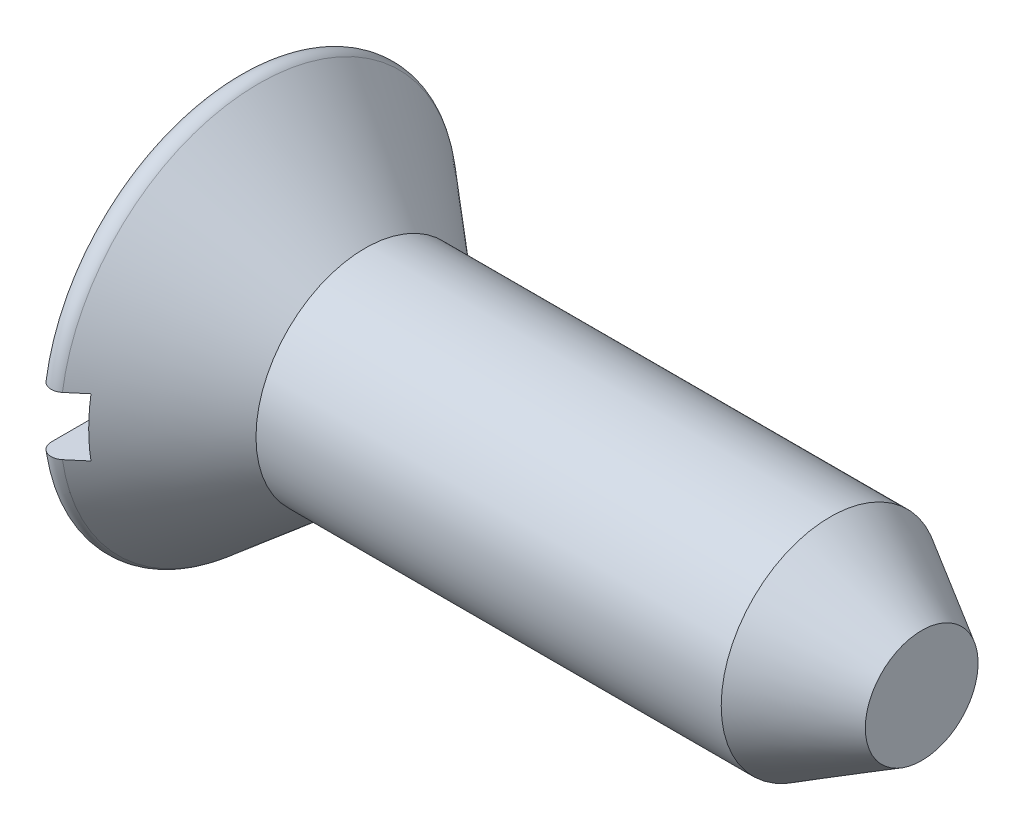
ISO-10303-21;
HEADER;
FILE_DESCRIPTION(('STEP AP214'),'2;1');
FILE_NAME('part.step','',(''),(''),'','','');
FILE_SCHEMA(('AUTOMOTIVE_DESIGN { 1 0 10303 214 1 1 1 1 }'));
ENDSEC;
DATA;
#1=APPLICATION_CONTEXT('core data for automotive mechanical design processes');
#2=APPLICATION_PROTOCOL_DEFINITION('international standard','automotive_design',2000,#1);
#3=PRODUCT_CONTEXT('',#1,'mechanical');
#4=PRODUCT('Part','Part','',(#3));
#5=PRODUCT_RELATED_PRODUCT_CATEGORY('part','',(#4));
#6=PRODUCT_DEFINITION_FORMATION('','',#4);
#7=PRODUCT_DEFINITION_CONTEXT('part definition',#1,'design');
#8=PRODUCT_DEFINITION('design','',#6,#7);
#9=PRODUCT_DEFINITION_SHAPE('','',#8);
#10=(LENGTH_UNIT() NAMED_UNIT(*) SI_UNIT(.MILLI.,.METRE.));
#11=(NAMED_UNIT(*) PLANE_ANGLE_UNIT() SI_UNIT($,.RADIAN.));
#12=(NAMED_UNIT(*) SI_UNIT($,.STERADIAN.) SOLID_ANGLE_UNIT());
#13=UNCERTAINTY_MEASURE_WITH_UNIT(LENGTH_MEASURE(1.E-05),#10,'distance_accuracy_value','');
#14=(GEOMETRIC_REPRESENTATION_CONTEXT(3) GLOBAL_UNCERTAINTY_ASSIGNED_CONTEXT((#13)) GLOBAL_UNIT_ASSIGNED_CONTEXT((#10,
#11,#12)) REPRESENTATION_CONTEXT('',''));
#15=CARTESIAN_POINT('',(0.,0.,0.));
#16=DIRECTION('',(0.,0.,1.));
#17=DIRECTION('',(1.,0.,0.));
#18=AXIS2_PLACEMENT_3D('',#15,#16,#17);
#19=CARTESIAN_POINT('',(0.,0.,0.));
#20=DIRECTION('',(-1.,0.,0.));
#21=DIRECTION('',(0.,0.,1.));
#22=AXIS2_PLACEMENT_3D('',#19,#20,#21);
#23=CYLINDRICAL_SURFACE('',#22,0.762);
#24=CARTESIAN_POINT('',(0.889,0.,0.));
#25=DIRECTION('',(-1.,0.,0.));
#26=DIRECTION('',(0.,0.,1.));
#27=AXIS2_PLACEMENT_3D('',#24,#25,#26);
#28=CIRCLE('',#27,0.762);
#29=CARTESIAN_POINT('',(0.889,0.,0.762));
#30=VERTEX_POINT('',#29);
#31=EDGE_CURVE('E166',#30,#30,#28,.T.);
#32=ORIENTED_EDGE('',*,*,#31,.F.);
#33=EDGE_LOOP('',(#32));
#34=FACE_BOUND('',#33,.T.);
#35=CARTESIAN_POINT('',(4.13728568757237,0.,0.));
#36=DIRECTION('',(-1.,0.,0.));
#37=DIRECTION('',(0.,0.,1.));
#38=AXIS2_PLACEMENT_3D('',#35,#36,#37);
#39=CIRCLE('',#38,0.762);
#40=CARTESIAN_POINT('',(4.13728568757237,0.,0.762));
#41=VERTEX_POINT('',#40);
#42=EDGE_CURVE('E215',#41,#41,#39,.T.);
#43=ORIENTED_EDGE('',*,*,#42,.T.);
#44=EDGE_LOOP('',(#43));
#45=FACE_BOUND('',#44,.T.);
#46=ADVANCED_FACE('F70',(#34,#45),#23,.T.);
#47=CARTESIAN_POINT('',(0.,0.,0.));
#48=DIRECTION('',(1.,0.,0.));
#49=DIRECTION('',(0.,0.,-1.));
#50=AXIS2_PLACEMENT_3D('',#47,#48,#49);
#51=PLANE('',#50);
#52=CARTESIAN_POINT('',(0.,0.,0.));
#53=DIRECTION('',(-1.,0.,0.));
#54=DIRECTION('',(0.,0.,1.));
#55=AXIS2_PLACEMENT_3D('',#52,#53,#54);
#56=CIRCLE('',#55,1.3173129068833);
#57=CARTESIAN_POINT('',(0.,0.2032,1.30154640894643));
#58=VERTEX_POINT('',#57);
#59=CARTESIAN_POINT('',(0.,0.2032,-1.30154640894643));
#60=VERTEX_POINT('',#59);
#61=EDGE_CURVE('E155',#58,#60,#56,.T.);
#62=ORIENTED_EDGE('',*,*,#61,.T.);
#63=DIRECTION('',(0.,0.,1.));
#64=VECTOR('',#63,1.);
#65=CARTESIAN_POINT('',(0.,0.2032,-1.4062129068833));
#66=LINE('',#65,#64);
#67=EDGE_CURVE('E200',#60,#58,#66,.T.);
#68=ORIENTED_EDGE('',*,*,#67,.T.);
#69=EDGE_LOOP('',(#62,#68));
#70=FACE_BOUND('',#69,.T.);
#71=ADVANCED_FACE('F227',(#70),#51,.F.);
#72=CARTESIAN_POINT('',(0.0889,0.,0.));
#73=DIRECTION('',(-1.,0.,0.));
#74=DIRECTION('',(0.,0.,1.));
#75=AXIS2_PLACEMENT_3D('',#72,#73,#74);
#76=TOROIDAL_SURFACE('',#75,1.3173129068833,0.0889000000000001);
#77=CARTESIAN_POINT('',(0.146043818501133,0.,0.));
#78=DIRECTION('',(-1.,0.,0.));
#79=DIRECTION('',(0.,0.,1.));
#80=AXIS2_PLACEMENT_3D('',#77,#78,#79);
#81=CIRCLE('',#80,1.38541425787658);
#82=CARTESIAN_POINT('',(0.146043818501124,0.2032,1.3704314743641));
#83=VERTEX_POINT('',#82);
#84=CARTESIAN_POINT('',(0.146043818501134,0.2032,-1.37043147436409));
#85=VERTEX_POINT('',#84);
#86=EDGE_CURVE('E162',#83,#85,#81,.T.);
#87=ORIENTED_EDGE('',*,*,#86,.T.);
#88=CARTESIAN_POINT('',(0.0303689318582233,0.2032,-1.36922992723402));
#89=CARTESIAN_POINT('',(0.0265865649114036,0.2032,-1.36588480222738));
#90=CARTESIAN_POINT('',(0.023086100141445,0.2032,-1.36221498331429));
#91=CARTESIAN_POINT('',(0.0167499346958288,0.2032,-1.35433519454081));
#92=CARTESIAN_POINT('',(0.0139151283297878,0.2032,-1.35012450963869));
#93=CARTESIAN_POINT('',(0.00899300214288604,0.2032,-1.34129166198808));
#94=CARTESIAN_POINT('',(0.00690499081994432,0.2032,-1.33666988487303));
#95=CARTESIAN_POINT('',(0.00352865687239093,0.2032,-1.32714461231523));
#96=CARTESIAN_POINT('',(0.00224013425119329,0.2032,-1.32224118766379));
#97=CARTESIAN_POINT('',(0.000488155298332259,0.2032,-1.31225105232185));
#98=CARTESIAN_POINT('',(3.09699241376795E-05,0.2032,-1.3071632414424));
#99=CARTESIAN_POINT('',(-2.79271646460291E-05,0.2032,-1.29698236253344));
#100=CARTESIAN_POINT('',(0.000370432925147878,0.2032,-1.29188929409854));
#101=CARTESIAN_POINT('',(0.00201624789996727,0.2032,-1.28181321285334));
#102=CARTESIAN_POINT('',(0.00326837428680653,0.2032,-1.27683096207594));
#103=CARTESIAN_POINT('',(0.00659289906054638,0.2032,-1.26714792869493));
#104=CARTESIAN_POINT('',(0.00866529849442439,0.2032,-1.2624471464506));
#105=CARTESIAN_POINT('',(0.0135694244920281,0.2032,-1.25347221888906));
#106=CARTESIAN_POINT('',(0.0163995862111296,0.2032,-1.24919721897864));
#107=CARTESIAN_POINT('',(0.0227439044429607,0.2032,-1.24118890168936));
#108=CARTESIAN_POINT('',(0.026258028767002,0.2032,-1.23745555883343));
#109=CARTESIAN_POINT('',(0.0338355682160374,0.2032,-1.2306760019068));
#110=CARTESIAN_POINT('',(0.0378934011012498,0.2032,-1.22762355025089));
#111=CARTESIAN_POINT('',(0.0464695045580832,0.2032,-1.22225388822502));
#112=CARTESIAN_POINT('',(0.0509877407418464,0.2032,-1.21993662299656));
#113=CARTESIAN_POINT('',(0.060292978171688,0.2032,-1.21613485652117));
#114=CARTESIAN_POINT('',(0.0650756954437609,0.2032,-1.21463986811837));
#115=CARTESIAN_POINT('',(0.0748254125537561,0.2032,-1.21248323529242));
#116=CARTESIAN_POINT('',(0.0797924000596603,0.2032,-1.21182153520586));
#117=CARTESIAN_POINT('',(0.0897162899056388,0.2032,-1.21135459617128));
#118=CARTESIAN_POINT('',(0.0946727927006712,0.2032,-1.21154082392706));
#119=CARTESIAN_POINT('',(0.104483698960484,0.2032,-1.21274443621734));
#120=CARTESIAN_POINT('',(0.109338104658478,0.2032,-1.21376180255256));
#121=CARTESIAN_POINT('',(0.11879915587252,0.2032,-1.21659385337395));
#122=CARTESIAN_POINT('',(0.123406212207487,0.2032,-1.21840716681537));
#123=CARTESIAN_POINT('',(0.132253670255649,0.2032,-1.22277598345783));
#124=CARTESIAN_POINT('',(0.136494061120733,0.2032,-1.22533150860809));
#125=CARTESIAN_POINT('',(0.144522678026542,0.2032,-1.23113086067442));
#126=CARTESIAN_POINT('',(0.148307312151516,0.2032,-1.23437965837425));
#127=CARTESIAN_POINT('',(0.155285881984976,0.2032,-1.24145937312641));
#128=CARTESIAN_POINT('',(0.158479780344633,0.2032,-1.24529032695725));
#129=CARTESIAN_POINT('',(0.16422909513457,0.2032,-1.25347716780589));
#130=CARTESIAN_POINT('',(0.166775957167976,0.2032,-1.25783906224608));
#131=CARTESIAN_POINT('',(0.171110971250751,0.2032,-1.26692483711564));
#132=CARTESIAN_POINT('',(0.172899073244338,0.2032,-1.27164874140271));
#133=CARTESIAN_POINT('',(0.175685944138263,0.2032,-1.28138319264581));
#134=CARTESIAN_POINT('',(0.176675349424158,0.2032,-1.28639642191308));
#135=CARTESIAN_POINT('',(0.177803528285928,0.2032,-1.29651778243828));
#136=CARTESIAN_POINT('',(0.177942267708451,0.2032,-1.30162591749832));
#137=CARTESIAN_POINT('',(0.17736314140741,0.2032,-1.31182120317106));
#138=CARTESIAN_POINT('',(0.17664065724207,0.2032,-1.31690809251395));
#139=CARTESIAN_POINT('',(0.174349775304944,0.2032,-1.32688782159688));
#140=CARTESIAN_POINT('',(0.17278138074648,0.2032,-1.33178066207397));
#141=CARTESIAN_POINT('',(0.168845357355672,0.2032,-1.34121887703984));
#142=CARTESIAN_POINT('',(0.166479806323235,0.2032,-1.34576511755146));
#143=CARTESIAN_POINT('',(0.161012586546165,0.2032,-1.35439120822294));
#144=CARTESIAN_POINT('',(0.15791094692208,0.2032,-1.35847107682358));
#145=CARTESIAN_POINT('',(0.151087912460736,0.2032,-1.36600970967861));
#146=CARTESIAN_POINT('',(0.147372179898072,0.2032,-1.36947359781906));
#147=CARTESIAN_POINT('',(0.139406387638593,0.2032,-1.37572010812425));
#148=CARTESIAN_POINT('',(0.135156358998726,0.2032,-1.37850276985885));
#149=CARTESIAN_POINT('',(0.126292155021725,0.2032,-1.38327612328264));
#150=CARTESIAN_POINT('',(0.121682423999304,0.2032,-1.38527506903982));
#151=CARTESIAN_POINT('',(0.112191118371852,0.2032,-1.38846296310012));
#152=CARTESIAN_POINT('',(0.107309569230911,0.2032,-1.38965198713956));
#153=CARTESIAN_POINT('',(0.0974585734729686,0.2032,-1.3911772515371));
#154=CARTESIAN_POINT('',(0.0924902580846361,0.2032,-1.39152080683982));
#155=CARTESIAN_POINT('',(0.0825654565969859,0.2032,-1.39136597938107));
#156=CARTESIAN_POINT('',(0.0776089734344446,0.2032,-1.39086740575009));
#157=CARTESIAN_POINT('',(0.0678643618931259,0.2032,-1.38904589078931));
#158=CARTESIAN_POINT('',(0.0630758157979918,0.2032,-1.38772517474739));
#159=CARTESIAN_POINT('',(0.0537917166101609,0.2032,-1.38430152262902));
#160=CARTESIAN_POINT('',(0.049295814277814,0.2032,-1.38219953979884));
#161=CARTESIAN_POINT('',(0.0423987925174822,0.2032,-1.37824212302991));
#162=CARTESIAN_POINT('',(0.0398658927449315,0.2032,-1.37661158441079));
#163=CARTESIAN_POINT('',(0.0349782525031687,0.2032,-1.37310246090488));
#164=CARTESIAN_POINT('',(0.0326235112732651,0.2032,-1.37122387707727));
#165=CARTESIAN_POINT('',(0.0303689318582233,0.2032,-1.36922992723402));
#166=B_SPLINE_CURVE_WITH_KNOTS('',3,(#88,#89,#90,#91,#92,#93,#94,#95,#96,#97,#98,#99,#100,#101,
#102,#103,#104,#105,#106,#107,#108,#109,#110,#111,#112,#113,#114,#115,#116,#117,#118,#119,#120,
#121,#122,#123,#124,#125,#126,#127,#128,#129,#130,#131,#132,#133,#134,#135,#136,#137,#138,#139,
#140,#141,#142,#143,#144,#145,#146,#147,#148,#149,#150,#151,#152,#153,#154,#155,#156,#157,#158,
#159,#160,#161,#162,#163,#164,#165),.UNSPECIFIED.,.T.,.F.,(4,2,2,2,2,2,2,2,2,2,2,2,2,2,2,2,2,2,
2,2,2,2,2,2,2,2,2,2,2,2,2,2,2,2,2,2,2,2,4),(0.,0.0151369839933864,0.0302941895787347,
0.0454373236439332,0.0605766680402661,0.0758297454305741,0.0910841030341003,0.106422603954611,
0.12176112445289,0.137068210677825,0.15237457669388,0.167534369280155,0.18269303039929,
0.197653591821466,0.212613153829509,0.227422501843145,0.242231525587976,0.257015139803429,
0.271799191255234,0.28669303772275,0.301587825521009,0.316670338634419,0.331753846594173,
0.347011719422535,0.36227020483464,0.377610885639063,0.392951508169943,0.408252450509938,
0.423552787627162,0.438719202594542,0.453884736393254,0.468885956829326,0.483885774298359,
0.498755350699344,0.513628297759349,0.528461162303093,0.543275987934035,0.552298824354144,
0.561321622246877),.UNSPECIFIED.);
#167=EDGE_CURVE('E173',#85,#60,#166,.T.);
#168=ORIENTED_EDGE('',*,*,#167,.T.);
#169=ORIENTED_EDGE('',*,*,#61,.F.);
#170=CARTESIAN_POINT('',(0.0519994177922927,0.2032,1.21962139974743));
#171=CARTESIAN_POINT('',(0.0474515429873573,0.2032,1.22172518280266));
#172=CARTESIAN_POINT('',(0.0430795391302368,0.2032,1.22421847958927));
#173=CARTESIAN_POINT('',(0.0348144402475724,0.2032,1.22990833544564));
#174=CARTESIAN_POINT('',(0.0309219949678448,0.2032,1.23310583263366));
#175=CARTESIAN_POINT('',(0.0237310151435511,0.2032,1.24010395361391));
#176=CARTESIAN_POINT('',(0.0204318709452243,0.2032,1.24390395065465));
#177=CARTESIAN_POINT('',(0.0145121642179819,0.2032,1.25199814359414));
#178=CARTESIAN_POINT('',(0.0118914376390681,0.2032,1.25629221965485));
#179=CARTESIAN_POINT('',(0.0073742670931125,0.2032,1.26529746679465));
#180=CARTESIAN_POINT('',(0.00548500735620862,0.2032,1.27001224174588));
#181=CARTESIAN_POINT('',(0.00251643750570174,0.2032,1.27969048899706));
#182=CARTESIAN_POINT('',(0.00143720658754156,0.2032,1.2846539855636));
#183=CARTESIAN_POINT('',(0.000111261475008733,0.2032,1.29473808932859));
#184=CARTESIAN_POINT('',(-0.000127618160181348,0.2032,1.29985972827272));
#185=CARTESIAN_POINT('',(0.000256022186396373,0.2032,1.31007074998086));
#186=CARTESIAN_POINT('',(0.000878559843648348,0.2032,1.31516013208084));
#187=CARTESIAN_POINT('',(0.00297131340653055,0.2032,1.32517157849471));
#188=CARTESIAN_POINT('',(0.00444309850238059,0.2032,1.33009331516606));
#189=CARTESIAN_POINT('',(0.00819672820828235,0.2032,1.33961767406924));
#190=CARTESIAN_POINT('',(0.0104785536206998,0.2032,1.34422030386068));
#191=CARTESIAN_POINT('',(0.0157751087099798,0.2032,1.35294667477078));
#192=CARTESIAN_POINT('',(0.0187855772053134,0.2032,1.35707300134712));
#193=CARTESIAN_POINT('',(0.0254631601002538,0.2032,1.36475501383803));
#194=CARTESIAN_POINT('',(0.029130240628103,0.2032,1.36831072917));
#195=CARTESIAN_POINT('',(0.0369769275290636,0.2032,1.37471139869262));
#196=CARTESIAN_POINT('',(0.0411508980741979,0.2032,1.3775632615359));
#197=CARTESIAN_POINT('',(0.0499223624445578,0.2032,1.3825171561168));
#198=CARTESIAN_POINT('',(0.0545198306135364,0.2032,1.38461923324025));
#199=CARTESIAN_POINT('',(0.0639565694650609,0.2032,1.38799180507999));
#200=CARTESIAN_POINT('',(0.0687928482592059,0.2032,1.38927067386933));
#201=CARTESIAN_POINT('',(0.0786119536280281,0.2032,1.39099241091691));
#202=CARTESIAN_POINT('',(0.0835947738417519,0.2032,1.39143531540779));
#203=CARTESIAN_POINT('',(0.0935311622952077,0.2032,1.39147158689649));
#204=CARTESIAN_POINT('',(0.0984847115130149,0.2032,1.39107042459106));
#205=CARTESIAN_POINT('',(0.108253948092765,0.2032,1.38944176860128));
#206=CARTESIAN_POINT('',(0.113069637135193,0.2032,1.38821428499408));
#207=CARTESIAN_POINT('',(0.122425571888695,0.2032,1.38497028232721));
#208=CARTESIAN_POINT('',(0.126965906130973,0.2032,1.38295401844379));
#209=CARTESIAN_POINT('',(0.135646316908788,0.2032,1.37819212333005));
#210=CARTESIAN_POINT('',(0.139786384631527,0.2032,1.37544647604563));
#211=CARTESIAN_POINT('',(0.147575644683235,0.2032,1.36928772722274));
#212=CARTESIAN_POINT('',(0.151221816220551,0.2032,1.36587080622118));
#213=CARTESIAN_POINT('',(0.157895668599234,0.2032,1.35847870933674));
#214=CARTESIAN_POINT('',(0.160923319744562,0.2032,1.35450350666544));
#215=CARTESIAN_POINT('',(0.166306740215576,0.2032,1.34606549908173));
#216=CARTESIAN_POINT('',(0.16865549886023,0.2032,1.34159822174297));
#217=CARTESIAN_POINT('',(0.172578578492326,0.2032,1.33233569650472));
#218=CARTESIAN_POINT('',(0.174152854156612,0.2032,1.32754042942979));
#219=CARTESIAN_POINT('',(0.176498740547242,0.2032,1.31770435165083));
#220=CARTESIAN_POINT('',(0.177261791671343,0.2032,1.31266149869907));
#221=CARTESIAN_POINT('',(0.177936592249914,0.2032,1.30251909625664));
#222=CARTESIAN_POINT('',(0.177848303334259,0.2032,1.29741954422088));
#223=CARTESIAN_POINT('',(0.176819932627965,0.2032,1.2872727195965));
#224=CARTESIAN_POINT('',(0.175874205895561,0.2032,1.28222601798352));
#225=CARTESIAN_POINT('',(0.17314855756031,0.2032,1.27236297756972));
#226=CARTESIAN_POINT('',(0.171368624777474,0.2032,1.26754664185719));
#227=CARTESIAN_POINT('',(0.167023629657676,0.2032,1.25828533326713));
#228=CARTESIAN_POINT('',(0.164459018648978,0.2032,1.2538401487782));
#229=CARTESIAN_POINT('',(0.158613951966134,0.2032,1.24544815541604));
#230=CARTESIAN_POINT('',(0.155333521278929,0.2032,1.24150132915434));
#231=CARTESIAN_POINT('',(0.148178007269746,0.2032,1.23425489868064));
#232=CARTESIAN_POINT('',(0.144308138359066,0.2032,1.23095014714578));
#233=CARTESIAN_POINT('',(0.136062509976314,0.2032,1.22504752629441));
#234=CARTESIAN_POINT('',(0.131686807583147,0.2032,1.22244957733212));
#235=CARTESIAN_POINT('',(0.122614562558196,0.2032,1.21806993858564));
#236=CARTESIAN_POINT('',(0.117922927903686,0.2032,1.21627808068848));
#237=CARTESIAN_POINT('',(0.108302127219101,0.2032,1.21351705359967));
#238=CARTESIAN_POINT('',(0.103372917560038,0.2032,1.21254803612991));
#239=CARTESIAN_POINT('',(0.093474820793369,0.2032,1.21146948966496));
#240=CARTESIAN_POINT('',(0.0885069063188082,0.2032,1.21135096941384));
#241=CARTESIAN_POINT('',(0.0786266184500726,0.2032,1.21195374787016));
#242=CARTESIAN_POINT('',(0.0737141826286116,0.2032,1.21267398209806));
#243=CARTESIAN_POINT('',(0.0659940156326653,0.2032,1.21448083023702));
#244=CARTESIAN_POINT('',(0.0631233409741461,0.2032,1.21530932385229));
#245=CARTESIAN_POINT('',(0.0574807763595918,0.2032,1.21725292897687));
#246=CARTESIAN_POINT('',(0.0547088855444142,0.2032,1.21836803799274));
#247=CARTESIAN_POINT('',(0.0519994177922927,0.2032,1.21962139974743));
#248=B_SPLINE_CURVE_WITH_KNOTS('',3,(#170,#171,#172,#173,#174,#175,#176,#177,#178,#179,#180,
#181,#182,#183,#184,#185,#186,#187,#188,#189,#190,#191,#192,#193,#194,#195,#196,#197,#198,#199,
#200,#201,#202,#203,#204,#205,#206,#207,#208,#209,#210,#211,#212,#213,#214,#215,#216,#217,#218,
#219,#220,#221,#222,#223,#224,#225,#226,#227,#228,#229,#230,#231,#232,#233,#234,#235,#236,#237,
#238,#239,#240,#241,#242,#243,#244,#245,#246,#247),.UNSPECIFIED.,.T.,.F.,(4,2,2,2,2,2,2,2,2,2,2,
2,2,2,2,2,2,2,2,2,2,2,2,2,2,2,2,2,2,2,2,2,2,2,2,2,2,2,4),(0.,0.0150216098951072,
0.0300633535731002,0.0450895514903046,0.0601121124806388,0.0752786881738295,0.0904467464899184,
0.10575584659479,0.121065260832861,0.136403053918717,0.151740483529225,0.166990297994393,
0.182239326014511,0.197332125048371,0.21242401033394,0.227359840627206,0.242295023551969,
0.257133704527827,0.271972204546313,0.286805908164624,0.30163993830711,0.316560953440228,
0.331482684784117,0.346553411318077,0.361625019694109,0.376854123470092,0.392083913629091,
0.40741470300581,0.422745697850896,0.438067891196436,0.453389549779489,0.468582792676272,
0.483774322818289,0.498768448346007,0.513765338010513,0.528603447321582,0.543422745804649,
0.552372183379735,0.561321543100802),.UNSPECIFIED.);
#249=EDGE_CURVE('E169',#58,#83,#248,.T.);
#250=ORIENTED_EDGE('',*,*,#249,.T.);
#251=EDGE_LOOP('',(#87,#168,#169,#250));
#252=FACE_BOUND('',#251,.T.);
#253=ADVANCED_FACE('F207',(#252),#76,.T.);
#254=CARTESIAN_POINT('',(0.,-0.2032,-1.30154640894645));
#255=VERTEX_POINT('',#254);
#256=CARTESIAN_POINT('',(0.,-0.2032,1.30154640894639));
#257=VERTEX_POINT('',#256);
#258=EDGE_CURVE('E157',#255,#257,#56,.T.);
#259=ORIENTED_EDGE('',*,*,#258,.T.);
#260=DIRECTION('',(0.,0.,1.));
#261=VECTOR('',#260,1.);
#262=CARTESIAN_POINT('',(0.,-0.2032,-1.4062129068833));
#263=LINE('',#262,#261);
#264=EDGE_CURVE('E142',#255,#257,#263,.T.);
#265=ORIENTED_EDGE('',*,*,#264,.F.);
#266=EDGE_LOOP('',(#259,#265));
#267=FACE_BOUND('',#266,.T.);
#268=ADVANCED_FACE('F72',(#267),#51,.F.);
#269=ORIENTED_EDGE('',*,*,#258,.F.);
#270=CARTESIAN_POINT('',(0.0303689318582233,-0.2032,-1.36922992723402));
#271=CARTESIAN_POINT('',(0.0340946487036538,-0.2032,-1.37252435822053));
#272=CARTESIAN_POINT('',(0.0380991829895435,-0.2032,-1.37550858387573));
#273=CARTESIAN_POINT('',(0.0465549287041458,-0.2032,-1.38076603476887));
#274=CARTESIAN_POINT('',(0.051006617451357,-0.2032,-1.38303848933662));
#275=CARTESIAN_POINT('',(0.0602289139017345,-0.2032,-1.38680158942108));
#276=CARTESIAN_POINT('',(0.0649994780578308,-0.2032,-1.38829234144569));
#277=CARTESIAN_POINT('',(0.0747226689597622,-0.2032,-1.39044677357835));
#278=CARTESIAN_POINT('',(0.079675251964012,-0.2032,-1.39111065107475));
#279=CARTESIAN_POINT('',(0.0895971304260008,-0.2032,-1.39159075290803));
#280=CARTESIAN_POINT('',(0.094566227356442,-0.2032,-1.39141108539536));
#281=CARTESIAN_POINT('',(0.104403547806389,-0.2032,-1.39021889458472));
#282=CARTESIAN_POINT('',(0.109271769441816,-0.2032,-1.38920635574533));
#283=CARTESIAN_POINT('',(0.118763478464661,-0.2032,-1.38638053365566));
#284=CARTESIAN_POINT('',(0.123387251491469,-0.2032,-1.38456820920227));
#285=CARTESIAN_POINT('',(0.132267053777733,-0.2032,-1.38019684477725));
#286=CARTESIAN_POINT('',(0.136523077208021,-0.2032,-1.37763779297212));
#287=CARTESIAN_POINT('',(0.144570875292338,-0.2032,-1.37183291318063));
#288=CARTESIAN_POINT('',(0.148360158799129,-0.2032,-1.3685836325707));
#289=CARTESIAN_POINT('',(0.155345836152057,-0.2032,-1.36150050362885));
#290=CARTESIAN_POINT('',(0.158542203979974,-0.2032,-1.35766662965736));
#291=CARTESIAN_POINT('',(0.164284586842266,-0.2032,-1.34948404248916));
#292=CARTESIAN_POINT('',(0.166824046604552,-0.2032,-1.34513072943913));
#293=CARTESIAN_POINT('',(0.171144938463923,-0.2032,-1.33606294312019));
#294=CARTESIAN_POINT('',(0.172926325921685,-0.2032,-1.33134844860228));
#295=CARTESIAN_POINT('',(0.175699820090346,-0.2032,-1.32163841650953));
#296=CARTESIAN_POINT('',(0.17668333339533,-0.2032,-1.31664042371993));
#297=CARTESIAN_POINT('',(0.177804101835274,-0.2032,-1.3065503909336));
#298=CARTESIAN_POINT('',(0.177941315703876,-0.2032,-1.30145834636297));
#299=CARTESIAN_POINT('',(0.17736442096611,-0.2032,-1.29128491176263));
#300=CARTESIAN_POINT('',(0.1766440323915,-0.2032,-1.28620387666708));
#301=CARTESIAN_POINT('',(0.174361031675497,-0.2032,-1.27623453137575));
#302=CARTESIAN_POINT('',(0.172798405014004,-0.2032,-1.27134622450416));
#303=CARTESIAN_POINT('',(0.168871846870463,-0.2032,-1.26189973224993));
#304=CARTESIAN_POINT('',(0.166507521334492,-0.2032,-1.25734171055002));
#305=CARTESIAN_POINT('',(0.16104173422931,-0.2032,-1.24869122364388));
#306=CARTESIAN_POINT('',(0.157940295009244,-0.2032,-1.24459874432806));
#307=CARTESIAN_POINT('',(0.151111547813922,-0.2032,-1.23702970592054));
#308=CARTESIAN_POINT('',(0.147389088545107,-0.2032,-1.23354877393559));
#309=CARTESIAN_POINT('',(0.139406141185,-0.2032,-1.2272708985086));
#310=CARTESIAN_POINT('',(0.135145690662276,-0.2032,-1.22447390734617));
#311=CARTESIAN_POINT('',(0.126265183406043,-0.2032,-1.21968113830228));
#312=CARTESIAN_POINT('',(0.121650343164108,-0.2032,-1.21767569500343));
#313=CARTESIAN_POINT('',(0.112146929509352,-0.2032,-1.21447850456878));
#314=CARTESIAN_POINT('',(0.107258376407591,-0.2032,-1.21328669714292));
#315=CARTESIAN_POINT('',(0.0974077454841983,-0.2032,-1.21176329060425));
#316=CARTESIAN_POINT('',(0.0924471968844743,-0.2032,-1.21142179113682));
#317=CARTESIAN_POINT('',(0.0825397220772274,-0.2032,-1.21158078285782));
#318=CARTESIAN_POINT('',(0.0775927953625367,-0.2032,-1.21208124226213));
#319=CARTESIAN_POINT('',(0.0678769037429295,-0.2032,-1.21390421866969));
#320=CARTESIAN_POINT('',(0.0631072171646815,-0.2032,-1.21522289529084));
#321=CARTESIAN_POINT('',(0.0538553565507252,-0.2032,-1.21863856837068));
#322=CARTESIAN_POINT('',(0.0493731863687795,-0.2032,-1.22073557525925));
#323=CARTESIAN_POINT('',(0.0407992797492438,-0.2032,-1.22565694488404));
#324=CARTESIAN_POINT('',(0.0367095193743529,-0.2032,-1.22848474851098));
#325=CARTESIAN_POINT('',(0.0290558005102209,-0.2032,-1.23477949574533));
#326=CARTESIAN_POINT('',(0.0254918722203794,-0.2032,-1.23824647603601));
#327=CARTESIAN_POINT('',(0.0189463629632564,-0.2032,-1.24576373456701));
#328=CARTESIAN_POINT('',(0.015972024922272,-0.2032,-1.24982031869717));
#329=CARTESIAN_POINT('',(0.0107366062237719,-0.2032,-1.25837020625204));
#330=CARTESIAN_POINT('',(0.00847557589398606,-0.2032,-1.2628635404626));
#331=CARTESIAN_POINT('',(0.00470202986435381,-0.2032,-1.27222012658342));
#332=CARTESIAN_POINT('',(0.00319927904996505,-0.2032,-1.27708731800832));
#333=CARTESIAN_POINT('',(0.00102525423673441,-0.2032,-1.28700385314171));
#334=CARTESIAN_POINT('',(0.000353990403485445,-0.2032,-1.29205319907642));
#335=CARTESIAN_POINT('',(-0.000140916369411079,-0.2032,-1.30223182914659));
#336=CARTESIAN_POINT('',(4.19118878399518E-05,-0.2032,-1.30736142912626));
#337=CARTESIAN_POINT('',(0.00126627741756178,-0.2032,-1.31751863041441));
#338=CARTESIAN_POINT('',(0.00230803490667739,-0.2032,-1.32254620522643));
#339=CARTESIAN_POINT('',(0.00522359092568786,-0.2032,-1.33235559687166));
#340=CARTESIAN_POINT('',(0.00709767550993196,-0.2032,-1.33713732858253));
#341=CARTESIAN_POINT('',(0.0116267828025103,-0.2032,-1.34631066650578));
#342=CARTESIAN_POINT('',(0.0142808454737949,-0.2032,-1.35070274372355));
#343=CARTESIAN_POINT('',(0.019197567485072,-0.2032,-1.35746258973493));
#344=CARTESIAN_POINT('',(0.0212509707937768,-0.2032,-1.35998521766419));
#345=CARTESIAN_POINT('',(0.0256195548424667,-0.2032,-1.36479267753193));
#346=CARTESIAN_POINT('',(0.0279347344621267,-0.2032,-1.36707751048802));
#347=CARTESIAN_POINT('',(0.0303689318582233,-0.2032,-1.36922992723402));
#348=B_SPLINE_CURVE_WITH_KNOTS('',3,(#270,#271,#272,#273,#274,#275,#276,#277,#278,#279,#280,
#281,#282,#283,#284,#285,#286,#287,#288,#289,#290,#291,#292,#293,#294,#295,#296,#297,#298,#299,
#300,#301,#302,#303,#304,#305,#306,#307,#308,#309,#310,#311,#312,#313,#314,#315,#316,#317,#318,
#319,#320,#321,#322,#323,#324,#325,#326,#327,#328,#329,#330,#331,#332,#333,#334,#335,#336,#337,
#338,#339,#340,#341,#342,#343,#344,#345,#346,#347),.UNSPECIFIED.,.T.,.F.,(4,2,2,2,2,2,2,2,2,2,2,
2,2,2,2,2,2,2,2,2,2,2,2,2,2,2,2,2,2,2,2,2,2,2,2,2,2,2,4),(0.,0.0149083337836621,
0.0298327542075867,0.0447551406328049,0.059673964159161,0.0745202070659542,0.0893667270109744,
0.104195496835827,0.119024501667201,0.133929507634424,0.148835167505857,0.163884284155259,
0.178934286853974,0.194144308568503,0.209355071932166,0.224677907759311,0.240001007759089,
0.25533165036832,0.270661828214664,0.28587748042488,0.30109207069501,0.316114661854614,
0.331136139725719,0.345981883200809,0.360827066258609,0.375603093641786,0.390379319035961,
0.405226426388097,0.420074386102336,0.435094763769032,0.450116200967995,0.465326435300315,
0.480536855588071,0.49586270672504,0.511192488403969,0.526527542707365,0.541843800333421,
0.551584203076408,0.561324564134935),.UNSPECIFIED.);
#349=CARTESIAN_POINT('',(0.146043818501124,-0.2032,-1.3704314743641));
#350=VERTEX_POINT('',#349);
#351=EDGE_CURVE('E199',#255,#350,#348,.T.);
#352=ORIENTED_EDGE('',*,*,#351,.T.);
#353=CARTESIAN_POINT('',(0.146043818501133,-0.2032,1.37043147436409));
#354=VERTEX_POINT('',#353);
#355=EDGE_CURVE('E148',#350,#354,#81,.T.);
#356=ORIENTED_EDGE('',*,*,#355,.T.);
#357=CARTESIAN_POINT('',(0.0519994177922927,-0.2032,1.21962139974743));
#358=CARTESIAN_POINT('',(0.0564794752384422,-0.2032,1.21754948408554));
#359=CARTESIAN_POINT('',(0.0611366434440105,-0.2032,1.21585248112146));
#360=CARTESIAN_POINT('',(0.0706733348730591,-0.2032,1.21326272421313));
#361=CARTESIAN_POINT('',(0.0755530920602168,-0.2032,1.2123708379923));
#362=CARTESIAN_POINT('',(0.0853922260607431,-0.2032,1.21142102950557));
#363=CARTESIAN_POINT('',(0.0903515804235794,-0.2032,1.21136287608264));
#364=CARTESIAN_POINT('',(0.100208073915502,-0.2032,1.2120819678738));
#365=CARTESIAN_POINT('',(0.10510522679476,-0.2032,1.21285902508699));
#366=CARTESIAN_POINT('',(0.114690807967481,-0.2032,1.21522197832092));
#367=CARTESIAN_POINT('',(0.119379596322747,-0.2032,1.21680641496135));
#368=CARTESIAN_POINT('',(0.128427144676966,-0.2032,1.22073528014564));
#369=CARTESIAN_POINT('',(0.132785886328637,-0.2032,1.22307975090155));
#370=CARTESIAN_POINT('',(0.14107975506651,-0.2032,1.22847581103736));
#371=CARTESIAN_POINT('',(0.145012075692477,-0.2032,1.23153171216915));
#372=CARTESIAN_POINT('',(0.152315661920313,-0.2032,1.23825300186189));
#373=CARTESIAN_POINT('',(0.155686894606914,-0.2032,1.24191842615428));
#374=CARTESIAN_POINT('',(0.161816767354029,-0.2032,1.24980237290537));
#375=CARTESIAN_POINT('',(0.164567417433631,-0.2032,1.25402710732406));
#376=CARTESIAN_POINT('',(0.169330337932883,-0.2032,1.26287406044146));
#377=CARTESIAN_POINT('',(0.171342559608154,-0.2032,1.26749630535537));
#378=CARTESIAN_POINT('',(0.174595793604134,-0.2032,1.27706722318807));
#379=CARTESIAN_POINT('',(0.175827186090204,-0.2032,1.28201916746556));
#380=CARTESIAN_POINT('',(0.17744716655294,-0.2032,1.29205912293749));
#381=CARTESIAN_POINT('',(0.177835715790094,-0.2032,1.29714714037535));
#382=CARTESIAN_POINT('',(0.177758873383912,-0.2032,1.30734995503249));
#383=CARTESIAN_POINT('',(0.177287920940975,-0.2032,1.31246471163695));
#384=CARTESIAN_POINT('',(0.175492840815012,-0.2032,1.32254238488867));
#385=CARTESIAN_POINT('',(0.174168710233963,-0.2032,1.32750530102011));
#386=CARTESIAN_POINT('',(0.170704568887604,-0.2032,1.33712973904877));
#387=CARTESIAN_POINT('',(0.168565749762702,-0.2032,1.34179168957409));
#388=CARTESIAN_POINT('',(0.163529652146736,-0.2032,1.35068630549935));
#389=CARTESIAN_POINT('',(0.160632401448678,-0.2032,1.35491898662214));
#390=CARTESIAN_POINT('',(0.154185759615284,-0.2032,1.36279755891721));
#391=CARTESIAN_POINT('',(0.150641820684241,-0.2032,1.36644791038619));
#392=CARTESIAN_POINT('',(0.142985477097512,-0.2032,1.37309384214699));
#393=CARTESIAN_POINT('',(0.138873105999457,-0.2032,1.37608946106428));
#394=CARTESIAN_POINT('',(0.130244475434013,-0.2032,1.3813065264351));
#395=CARTESIAN_POINT('',(0.125733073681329,-0.2032,1.38353600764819));
#396=CARTESIAN_POINT('',(0.116397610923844,-0.2032,1.38719789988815));
#397=CARTESIAN_POINT('',(0.111573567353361,-0.2032,1.38863035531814));
#398=CARTESIAN_POINT('',(0.101797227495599,-0.2032,1.39064517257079));
#399=CARTESIAN_POINT('',(0.096846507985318,-0.2032,1.39123519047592));
#400=CARTESIAN_POINT('',(0.0869165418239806,-0.2032,1.39157191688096));
#401=CARTESIAN_POINT('',(0.0819372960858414,-0.2032,1.39131865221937));
#402=CARTESIAN_POINT('',(0.0721129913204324,-0.2032,1.3899793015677));
#403=CARTESIAN_POINT('',(0.0672674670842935,-0.2032,1.38889662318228));
#404=CARTESIAN_POINT('',(0.0578263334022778,-0.2032,1.38593496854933));
#405=CARTESIAN_POINT('',(0.0532307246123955,-0.2032,1.38405599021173));
#406=CARTESIAN_POINT('',(0.0444074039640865,-0.2032,1.37955210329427));
#407=CARTESIAN_POINT('',(0.0401805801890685,-0.2032,1.37692545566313));
#408=CARTESIAN_POINT('',(0.0322234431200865,-0.2032,1.37100505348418));
#409=CARTESIAN_POINT('',(0.0284931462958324,-0.2032,1.36771127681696));
#410=CARTESIAN_POINT('',(0.0216026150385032,-0.2032,1.36052300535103));
#411=CARTESIAN_POINT('',(0.0184471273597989,-0.2032,1.35662396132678));
#412=CARTESIAN_POINT('',(0.0128273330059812,-0.2032,1.34835615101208));
#413=CARTESIAN_POINT('',(0.0103630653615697,-0.2032,1.34398735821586));
#414=CARTESIAN_POINT('',(0.00616781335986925,-0.2032,1.33485418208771));
#415=CARTESIAN_POINT('',(0.00444494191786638,-0.2032,1.33008607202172));
#416=CARTESIAN_POINT('',(0.00181577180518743,-0.2032,1.32032978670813));
#417=CARTESIAN_POINT('',(0.000909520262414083,-0.2032,1.31534159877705));
#418=CARTESIAN_POINT('',(-6.80779717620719E-05,-0.2032,1.30523659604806));
#419=CARTESIAN_POINT('',(-0.000131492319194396,-0.2032,1.30011901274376));
#420=CARTESIAN_POINT('',(0.000598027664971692,-0.2032,1.28994533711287));
#421=CARTESIAN_POINT('',(0.00139095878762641,-0.2032,1.28488924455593));
#422=CARTESIAN_POINT('',(0.00381642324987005,-0.2032,1.27496177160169));
#423=CARTESIAN_POINT('',(0.00545218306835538,-0.2032,1.27009117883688));
#424=CARTESIAN_POINT('',(0.00952181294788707,-0.2032,1.26069393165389));
#425=CARTESIAN_POINT('',(0.0119558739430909,-0.2032,1.25616735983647));
#426=CARTESIAN_POINT('',(0.0175456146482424,-0.2032,1.24760688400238));
#427=CARTESIAN_POINT('',(0.020698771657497,-0.2032,1.24357133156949));
#428=CARTESIAN_POINT('',(0.0276425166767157,-0.2032,1.23609810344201));
#429=CARTESIAN_POINT('',(0.0314322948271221,-0.2032,1.23265967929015));
#430=CARTESIAN_POINT('',(0.0380466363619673,-0.2032,1.22762005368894));
#431=CARTESIAN_POINT('',(0.040713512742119,-0.2032,1.2258082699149));
#432=CARTESIAN_POINT('',(0.0462282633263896,-0.2032,1.22248491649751));
#433=CARTESIAN_POINT('',(0.049076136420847,-0.2032,1.22097334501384));
#434=CARTESIAN_POINT('',(0.0519994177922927,-0.2032,1.21962139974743));
#435=B_SPLINE_CURVE_WITH_KNOTS('',3,(#357,#358,#359,#360,#361,#362,#363,#364,#365,#366,#367,
#368,#369,#370,#371,#372,#373,#374,#375,#376,#377,#378,#379,#380,#381,#382,#383,#384,#385,#386,
#387,#388,#389,#390,#391,#392,#393,#394,#395,#396,#397,#398,#399,#400,#401,#402,#403,#404,#405,
#406,#407,#408,#409,#410,#411,#412,#413,#414,#415,#416,#417,#418,#419,#420,#421,#422,#423,#424,
#425,#426,#427,#428,#429,#430,#431,#432,#433,#434),.UNSPECIFIED.,.T.,.F.,(4,2,2,2,2,2,2,2,2,2,2,
2,2,2,2,2,2,2,2,2,2,2,2,2,2,2,2,2,2,2,2,2,2,2,2,2,2,2,4),(0.,0.0147962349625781,
0.0296083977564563,0.0444164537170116,0.0592211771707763,0.0739992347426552,0.0887781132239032,
0.103649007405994,0.118520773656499,0.133574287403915,0.148628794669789,0.163865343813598,
0.179102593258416,0.194438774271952,0.209775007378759,0.225088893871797,0.240402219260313,
0.25559194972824,0.270780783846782,0.285805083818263,0.30082854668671,0.315714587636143,
0.330600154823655,0.345424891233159,0.360249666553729,0.375109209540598,0.389969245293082,
0.404946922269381,0.419925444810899,0.435063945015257,0.450203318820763,0.465485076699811,
0.480766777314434,0.496107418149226,0.511451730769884,0.526743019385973,0.542015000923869,
0.551669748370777,0.561324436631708),.UNSPECIFIED.);
#436=EDGE_CURVE('E91',#354,#257,#435,.T.);
#437=ORIENTED_EDGE('',*,*,#436,.T.);
#438=EDGE_LOOP('',(#269,#352,#356,#437));
#439=FACE_BOUND('',#438,.T.);
#440=ADVANCED_FACE('F177',(#439),#76,.T.);
#441=CARTESIAN_POINT('',(0.889,0.,0.));
#442=DIRECTION('',(-1.,0.,0.));
#443=DIRECTION('',(0.,0.,1.));
#444=AXIS2_PLACEMENT_3D('',#441,#442,#443);
#445=CONICAL_SURFACE('',#444,0.762,0.698131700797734);
#446=CARTESIAN_POINT('',(0.254,0.,0.));
#447=DIRECTION('',(1.,0.,0.));
#448=DIRECTION('',(0.,0.,-1.));
#449=AXIS2_PLACEMENT_3D('',#446,#447,#448);
#450=CIRCLE('',#449,1.29482826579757);
#451=CARTESIAN_POINT('',(0.254,-0.2032,-1.27878457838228));
#452=VERTEX_POINT('',#451);
#453=CARTESIAN_POINT('',(0.254,0.2032,-1.27878457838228));
#454=VERTEX_POINT('',#453);
#455=EDGE_CURVE('E84',#452,#454,#450,.T.);
#456=ORIENTED_EDGE('',*,*,#455,.T.);
#457=CARTESIAN_POINT('',(-1.51791465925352,0.2032,2.77420935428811));
#458=CARTESIAN_POINT('',(-1.40619674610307,0.2032,2.68021386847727));
#459=CARTESIAN_POINT('',(-1.2944896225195,0.2032,2.5862055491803));
#460=CARTESIAN_POINT('',(-1.07110945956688,0.2032,2.39814640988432));
#461=CARTESIAN_POINT('',(-0.959436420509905,0.2032,2.30409558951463));
#462=CARTESIAN_POINT('',(-0.736084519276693,0.2032,2.11589044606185));
#463=CARTESIAN_POINT('',(-0.624405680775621,0.2032,2.02173609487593));
#464=CARTESIAN_POINT('',(-0.40112234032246,0.2032,1.83334119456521));
#465=CARTESIAN_POINT('',(-0.28951783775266,0.2032,1.73910064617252));
#466=CARTESIAN_POINT('',(-0.0739615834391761,0.2032,1.5568534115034));
#467=CARTESIAN_POINT('',(0.0299977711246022,0.2032,1.46885572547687));
#468=CARTESIAN_POINT('',(0.23774671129,0.2032,1.29265521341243));
#469=CARTESIAN_POINT('',(0.341536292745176,0.2032,1.20445238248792));
#470=CARTESIAN_POINT('',(0.54877107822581,0.2032,1.02771614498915));
#471=CARTESIAN_POINT('',(0.652216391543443,0.2032,0.939182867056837));
#472=CARTESIAN_POINT('',(0.806849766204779,0.2032,0.805766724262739));
#473=CARTESIAN_POINT('',(0.858304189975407,0.2032,0.761192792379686));
#474=CARTESIAN_POINT('',(0.960914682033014,0.2032,0.67170319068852));
#475=CARTESIAN_POINT('',(1.01207075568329,0.2032,0.626787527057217));
#476=CARTESIAN_POINT('',(1.09182001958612,0.2032,0.555898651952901));
#477=CARTESIAN_POINT('',(1.12060058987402,0.2032,0.530136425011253));
#478=CARTESIAN_POINT('',(1.17790374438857,0.2032,0.478298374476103));
#479=CARTESIAN_POINT('',(1.20642620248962,0.2032,0.452222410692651));
#480=CARTESIAN_POINT('',(1.26355992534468,0.2032,0.399104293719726));
#481=CARTESIAN_POINT('',(1.29216286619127,0.2032,0.37205319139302));
#482=CARTESIAN_POINT('',(1.34854405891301,0.2032,0.317151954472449));
#483=CARTESIAN_POINT('',(1.37632325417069,0.2032,0.28930281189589));
#484=CARTESIAN_POINT('',(1.41691764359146,0.2032,0.246097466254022));
#485=CARTESIAN_POINT('',(1.43036673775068,0.2032,0.231340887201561));
#486=CARTESIAN_POINT('',(1.45654404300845,0.2032,0.201206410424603));
#487=CARTESIAN_POINT('',(1.46927272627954,0.2032,0.185828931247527));
#488=CARTESIAN_POINT('',(1.49330480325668,0.2032,0.154408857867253));
#489=CARTESIAN_POINT('',(1.50462910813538,0.2032,0.138382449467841));
#490=CARTESIAN_POINT('',(1.52506199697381,0.2032,0.105003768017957));
#491=CARTESIAN_POINT('',(1.53418447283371,0.2032,0.0876607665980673));
#492=CARTESIAN_POINT('',(1.54500407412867,0.2032,0.0595686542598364));
#493=CARTESIAN_POINT('',(1.54819076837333,0.2032,0.0494137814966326));
#494=CARTESIAN_POINT('',(1.55284249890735,0.2032,0.028722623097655));
#495=CARTESIAN_POINT('',(1.55431173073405,0.2032,0.0181873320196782));
#496=CARTESIAN_POINT('',(1.5552556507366,0.2032,-0.00303695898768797));
#497=CARTESIAN_POINT('',(1.5547191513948,0.2032,-0.0137264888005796));
#498=CARTESIAN_POINT('',(1.55173771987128,0.2032,-0.0348456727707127));
#499=CARTESIAN_POINT('',(1.54928811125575,0.2032,-0.0452746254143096));
#500=CARTESIAN_POINT('',(1.54133969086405,0.2032,-0.0706220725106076));
#501=CARTESIAN_POINT('',(1.53493598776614,0.2032,-0.0852457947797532));
#502=CARTESIAN_POINT('',(1.52016612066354,0.2032,-0.113476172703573));
#503=CARTESIAN_POINT('',(1.51179096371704,0.2032,-0.127077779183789));
#504=CARTESIAN_POINT('',(1.49370966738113,0.2032,-0.153777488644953));
#505=CARTESIAN_POINT('',(1.48397879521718,0.2032,-0.166858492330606));
#506=CARTESIAN_POINT('',(1.46377941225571,0.2032,-0.192443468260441));
#507=CARTESIAN_POINT('',(1.45331032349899,0.2032,-0.204946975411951));
#508=CARTESIAN_POINT('',(1.42115282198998,0.2032,-0.241908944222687));
#509=CARTESIAN_POINT('',(1.39876376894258,0.2032,-0.265752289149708));
#510=CARTESIAN_POINT('',(1.35299121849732,0.2032,-0.312675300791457));
#511=CARTESIAN_POINT('',(1.32960326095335,0.2032,-0.335750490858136));
#512=CARTESIAN_POINT('',(1.28234961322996,0.2032,-0.381323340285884));
#513=CARTESIAN_POINT('',(1.25848481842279,0.2032,-0.403821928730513));
#514=CARTESIAN_POINT('',(1.18707059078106,0.2032,-0.470219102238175));
#515=CARTESIAN_POINT('',(1.13907480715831,0.2032,-0.513634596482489));
#516=CARTESIAN_POINT('',(1.04253281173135,0.2032,-0.59985242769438));
#517=CARTESIAN_POINT('',(0.993986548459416,0.2032,-0.642654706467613));
#518=CARTESIAN_POINT('',(0.896542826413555,0.2032,-0.72793947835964));
#519=CARTESIAN_POINT('',(0.847645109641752,0.2032,-0.770421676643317));
#520=CARTESIAN_POINT('',(0.749663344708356,0.2032,-0.855166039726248));
#521=CARTESIAN_POINT('',(0.700579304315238,0.2032,-0.897428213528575));
#522=CARTESIAN_POINT('',(0.553690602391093,0.2032,-1.02353629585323));
#523=CARTESIAN_POINT('',(0.455707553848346,0.2032,-1.1071743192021));
#524=CARTESIAN_POINT('',(0.259538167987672,0.2032,-1.27415295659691));
#525=CARTESIAN_POINT('',(0.16135189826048,0.2032,-1.35749365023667));
#526=CARTESIAN_POINT('',(-0.0679780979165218,0.2032,-1.55183079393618));
#527=CARTESIAN_POINT('',(-0.19917428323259,0.2032,-1.66276533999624));
#528=CARTESIAN_POINT('',(-0.461708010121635,0.2032,-1.88449571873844));
#529=CARTESIAN_POINT('',(-0.593045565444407,0.2032,-1.99529153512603));
#530=CARTESIAN_POINT('',(-0.856616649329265,0.2032,-2.21748163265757));
#531=CARTESIAN_POINT('',(-0.988850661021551,0.2032,-2.32887534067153));
#532=CARTESIAN_POINT('',(-1.25335681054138,0.2032,-2.55158787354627));
#533=CARTESIAN_POINT('',(-1.38562894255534,0.2032,-2.66290670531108));
#534=CARTESIAN_POINT('',(-1.51791465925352,0.2032,-2.77420935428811));
#535=B_SPLINE_CURVE_WITH_KNOTS('',3,(#457,#458,#459,#460,#461,#462,#463,#464,#465,#466,#467,
#468,#469,#470,#471,#472,#473,#474,#475,#476,#477,#478,#479,#480,#481,#482,#483,#484,#485,#486,
#487,#488,#489,#490,#491,#492,#493,#494,#495,#496,#497,#498,#499,#500,#501,#502,#503,#504,#505,
#506,#507,#508,#509,#510,#511,#512,#513,#514,#515,#516,#517,#518,#519,#520,#521,#522,#523,#524,
#525,#526,#527,#528,#529,#530,#531,#532,#533,#534),.UNSPECIFIED.,.F.,.F.,(4,2,2,2,2,2,2,2,2,2,2,
2,2,2,2,2,2,2,2,2,2,2,2,2,2,2,2,2,2,2,2,2,2,2,2,2,2,2,4),(0.,0.438000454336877,
0.876004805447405,1.31422257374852,1.75243665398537,2.16104412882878,2.56966143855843,
2.97813351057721,3.18236208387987,3.38658697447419,3.50246573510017,3.61839835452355,
3.73650016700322,3.85446104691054,3.91434662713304,3.97419249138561,4.03299917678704,
4.09142452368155,4.12324077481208,4.15497913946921,4.18689479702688,4.21888871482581,
4.26650733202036,4.31434752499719,4.36321569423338,4.41212255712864,4.51018449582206,
4.60874281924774,4.70713083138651,4.90127332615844,5.09543412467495,5.28975604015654,
5.48406994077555,5.87054492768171,6.25690724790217,6.77233901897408,7.28782651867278,
7.80652633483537,8.32516894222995),.UNSPECIFIED.);
#536=EDGE_CURVE('E43',#454,#85,#535,.T.);
#537=ORIENTED_EDGE('',*,*,#536,.T.);
#538=ORIENTED_EDGE('',*,*,#86,.F.);
#539=CARTESIAN_POINT('',(0.254,0.2032,1.27878457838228));
#540=VERTEX_POINT('',#539);
#541=EDGE_CURVE('E74',#83,#540,#535,.T.);
#542=ORIENTED_EDGE('',*,*,#541,.T.);
#543=CARTESIAN_POINT('',(0.254,-0.2032,1.27878457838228));
#544=VERTEX_POINT('',#543);
#545=EDGE_CURVE('E138',#540,#544,#450,.T.);
#546=ORIENTED_EDGE('',*,*,#545,.T.);
#547=CARTESIAN_POINT('',(-1.51791465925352,-0.2032,-2.77420935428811));
#548=CARTESIAN_POINT('',(-1.40619674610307,-0.2032,-2.68021386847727));
#549=CARTESIAN_POINT('',(-1.2944896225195,-0.2032,-2.5862055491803));
#550=CARTESIAN_POINT('',(-1.07110945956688,-0.2032,-2.39814640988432));
#551=CARTESIAN_POINT('',(-0.959436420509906,-0.2032,-2.30409558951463));
#552=CARTESIAN_POINT('',(-0.736084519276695,-0.2032,-2.11589044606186));
#553=CARTESIAN_POINT('',(-0.624405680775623,-0.2032,-2.02173609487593));
#554=CARTESIAN_POINT('',(-0.401122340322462,-0.2032,-1.83334119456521));
#555=CARTESIAN_POINT('',(-0.289517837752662,-0.2032,-1.73910064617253));
#556=CARTESIAN_POINT('',(-0.0739615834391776,-0.2032,-1.5568534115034));
#557=CARTESIAN_POINT('',(0.0299977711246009,-0.2032,-1.46885572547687));
#558=CARTESIAN_POINT('',(0.237746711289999,-0.2032,-1.29265521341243));
#559=CARTESIAN_POINT('',(0.341536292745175,-0.2032,-1.20445238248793));
#560=CARTESIAN_POINT('',(0.548771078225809,-0.2032,-1.02771614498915));
#561=CARTESIAN_POINT('',(0.652216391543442,-0.2032,-0.939182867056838));
#562=CARTESIAN_POINT('',(0.806849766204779,-0.2032,-0.805766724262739));
#563=CARTESIAN_POINT('',(0.858304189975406,-0.2032,-0.761192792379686));
#564=CARTESIAN_POINT('',(0.960914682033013,-0.2032,-0.67170319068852));
#565=CARTESIAN_POINT('',(1.01207075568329,-0.2032,-0.626787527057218));
#566=CARTESIAN_POINT('',(1.09182001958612,-0.2032,-0.555898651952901));
#567=CARTESIAN_POINT('',(1.12060058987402,-0.2032,-0.530136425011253));
#568=CARTESIAN_POINT('',(1.17790374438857,-0.2032,-0.478298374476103));
#569=CARTESIAN_POINT('',(1.20642620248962,-0.2032,-0.452222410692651));
#570=CARTESIAN_POINT('',(1.26355992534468,-0.2032,-0.399104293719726));
#571=CARTESIAN_POINT('',(1.29216286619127,-0.2032,-0.37205319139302));
#572=CARTESIAN_POINT('',(1.34854405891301,-0.2032,-0.317151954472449));
#573=CARTESIAN_POINT('',(1.37632325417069,-0.2032,-0.289302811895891));
#574=CARTESIAN_POINT('',(1.41691764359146,-0.2032,-0.246097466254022));
#575=CARTESIAN_POINT('',(1.43036673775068,-0.2032,-0.231340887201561));
#576=CARTESIAN_POINT('',(1.45654404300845,-0.2032,-0.201206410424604));
#577=CARTESIAN_POINT('',(1.46927272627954,-0.2032,-0.185828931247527));
#578=CARTESIAN_POINT('',(1.49330480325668,-0.2032,-0.154408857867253));
#579=CARTESIAN_POINT('',(1.50462910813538,-0.2032,-0.138382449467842));
#580=CARTESIAN_POINT('',(1.52506199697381,-0.2032,-0.105003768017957));
#581=CARTESIAN_POINT('',(1.53418447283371,-0.2032,-0.0876607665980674));
#582=CARTESIAN_POINT('',(1.54500407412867,-0.2032,-0.0595686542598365));
#583=CARTESIAN_POINT('',(1.54819076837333,-0.2032,-0.0494137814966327));
#584=CARTESIAN_POINT('',(1.55284249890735,-0.2032,-0.0287226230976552));
#585=CARTESIAN_POINT('',(1.55431173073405,-0.2032,-0.0181873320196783));
#586=CARTESIAN_POINT('',(1.5552556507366,-0.2032,0.0030369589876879));
#587=CARTESIAN_POINT('',(1.5547191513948,-0.2032,0.0137264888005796));
#588=CARTESIAN_POINT('',(1.55173771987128,-0.2032,0.0348456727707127));
#589=CARTESIAN_POINT('',(1.54928811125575,-0.2032,0.0452746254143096));
#590=CARTESIAN_POINT('',(1.54133969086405,-0.2032,0.0706220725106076));
#591=CARTESIAN_POINT('',(1.53493598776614,-0.2032,0.0852457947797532));
#592=CARTESIAN_POINT('',(1.52016612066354,-0.2032,0.113476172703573));
#593=CARTESIAN_POINT('',(1.51179096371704,-0.2032,0.127077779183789));
#594=CARTESIAN_POINT('',(1.49370966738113,-0.2032,0.153777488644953));
#595=CARTESIAN_POINT('',(1.48397879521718,-0.2032,0.166858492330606));
#596=CARTESIAN_POINT('',(1.46377941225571,-0.2032,0.192443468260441));
#597=CARTESIAN_POINT('',(1.45331032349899,-0.2032,0.204946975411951));
#598=CARTESIAN_POINT('',(1.42115282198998,-0.2032,0.241908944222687));
#599=CARTESIAN_POINT('',(1.39876376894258,-0.2032,0.265752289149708));
#600=CARTESIAN_POINT('',(1.35299121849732,-0.2032,0.312675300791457));
#601=CARTESIAN_POINT('',(1.32960326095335,-0.2032,0.335750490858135));
#602=CARTESIAN_POINT('',(1.28234961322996,-0.2032,0.381323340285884));
#603=CARTESIAN_POINT('',(1.25848481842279,-0.2032,0.403821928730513));
#604=CARTESIAN_POINT('',(1.18707059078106,-0.2032,0.470219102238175));
#605=CARTESIAN_POINT('',(1.13907480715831,-0.2032,0.513634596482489));
#606=CARTESIAN_POINT('',(1.04253281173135,-0.2032,0.59985242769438));
#607=CARTESIAN_POINT('',(0.993986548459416,-0.2032,0.642654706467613));
#608=CARTESIAN_POINT('',(0.896542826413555,-0.2032,0.727939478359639));
#609=CARTESIAN_POINT('',(0.847645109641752,-0.2032,0.770421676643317));
#610=CARTESIAN_POINT('',(0.749663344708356,-0.2032,0.855166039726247));
#611=CARTESIAN_POINT('',(0.700579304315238,-0.2032,0.897428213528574));
#612=CARTESIAN_POINT('',(0.553690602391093,-0.2032,1.02353629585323));
#613=CARTESIAN_POINT('',(0.455707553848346,-0.2032,1.1071743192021));
#614=CARTESIAN_POINT('',(0.259538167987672,-0.2032,1.27415295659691));
#615=CARTESIAN_POINT('',(0.161351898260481,-0.2032,1.35749365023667));
#616=CARTESIAN_POINT('',(-0.067978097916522,-0.2032,1.55183079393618));
#617=CARTESIAN_POINT('',(-0.19917428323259,-0.2032,1.66276533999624));
#618=CARTESIAN_POINT('',(-0.461708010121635,-0.2032,1.88449571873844));
#619=CARTESIAN_POINT('',(-0.593045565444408,-0.2032,1.99529153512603));
#620=CARTESIAN_POINT('',(-0.856616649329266,-0.2032,2.21748163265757));
#621=CARTESIAN_POINT('',(-0.988850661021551,-0.2032,2.32887534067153));
#622=CARTESIAN_POINT('',(-1.25335681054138,-0.2032,2.55158787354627));
#623=CARTESIAN_POINT('',(-1.38562894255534,-0.2032,2.66290670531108));
#624=CARTESIAN_POINT('',(-1.51791465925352,-0.2032,2.77420935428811));
#625=B_SPLINE_CURVE_WITH_KNOTS('',3,(#547,#548,#549,#550,#551,#552,#553,#554,#555,#556,#557,
#558,#559,#560,#561,#562,#563,#564,#565,#566,#567,#568,#569,#570,#571,#572,#573,#574,#575,#576,
#577,#578,#579,#580,#581,#582,#583,#584,#585,#586,#587,#588,#589,#590,#591,#592,#593,#594,#595,
#596,#597,#598,#599,#600,#601,#602,#603,#604,#605,#606,#607,#608,#609,#610,#611,#612,#613,#614,
#615,#616,#617,#618,#619,#620,#621,#622,#623,#624),.UNSPECIFIED.,.F.,.F.,(4,2,2,2,2,2,2,2,2,2,2,
2,2,2,2,2,2,2,2,2,2,2,2,2,2,2,2,2,2,2,2,2,2,2,2,2,2,2,4),(0.,0.438000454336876,
0.876004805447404,1.31422257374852,1.75243665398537,2.16104412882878,2.56966143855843,
2.97813351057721,3.18236208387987,3.38658697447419,3.50246573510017,3.61839835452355,
3.73650016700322,3.85446104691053,3.91434662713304,3.9741924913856,4.03299917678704,
4.09142452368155,4.12324077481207,4.15497913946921,4.18689479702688,4.2188887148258,
4.26650733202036,4.31434752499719,4.36321569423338,4.41212255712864,4.51018449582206,
4.60874281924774,4.7071308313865,4.90127332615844,5.09543412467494,5.28975604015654,
5.48406994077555,5.8705449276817,6.25690724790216,6.77233901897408,7.28782651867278,
7.80652633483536,8.32516894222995),.UNSPECIFIED.);
#626=EDGE_CURVE('E141',#544,#354,#625,.T.);
#627=ORIENTED_EDGE('',*,*,#626,.T.);
#628=ORIENTED_EDGE('',*,*,#355,.F.);
#629=EDGE_CURVE('E137',#350,#452,#625,.T.);
#630=ORIENTED_EDGE('',*,*,#629,.T.);
#631=EDGE_LOOP('',(#456,#537,#538,#542,#546,#627,#628,#630));
#632=FACE_BOUND('',#631,.T.);
#633=ORIENTED_EDGE('',*,*,#31,.T.);
#634=EDGE_LOOP('',(#633));
#635=FACE_BOUND('',#634,.T.);
#636=ADVANCED_FACE('F145',(#632,#635),#445,.T.);
#637=CARTESIAN_POINT('',(0.,0.2032,-1.4062129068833));
#638=DIRECTION('',(0.,1.,0.));
#639=DIRECTION('',(0.,0.,1.));
#640=AXIS2_PLACEMENT_3D('',#637,#638,#639);
#641=PLANE('',#640);
#642=ORIENTED_EDGE('',*,*,#67,.F.);
#643=ORIENTED_EDGE('',*,*,#167,.F.);
#644=ORIENTED_EDGE('',*,*,#536,.F.);
#645=DIRECTION('',(0.,0.,1.));
#646=VECTOR('',#645,1.);
#647=CARTESIAN_POINT('',(0.254,0.2032,-1.4062129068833));
#648=LINE('',#647,#646);
#649=EDGE_CURVE('E134',#454,#540,#648,.T.);
#650=ORIENTED_EDGE('',*,*,#649,.T.);
#651=ORIENTED_EDGE('',*,*,#541,.F.);
#652=ORIENTED_EDGE('',*,*,#249,.F.);
#653=EDGE_LOOP('',(#642,#643,#644,#650,#651,#652));
#654=FACE_BOUND('',#653,.T.);
#655=ADVANCED_FACE('F179',(#654),#641,.F.);
#656=CARTESIAN_POINT('',(0.254,0.2032,-1.4062129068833));
#657=DIRECTION('',(1.,0.,0.));
#658=DIRECTION('',(0.,0.,-1.));
#659=AXIS2_PLACEMENT_3D('',#656,#657,#658);
#660=PLANE('',#659);
#661=ORIENTED_EDGE('',*,*,#649,.F.);
#662=ORIENTED_EDGE('',*,*,#455,.F.);
#663=DIRECTION('',(0.,0.,1.));
#664=VECTOR('',#663,1.);
#665=CARTESIAN_POINT('',(0.254,-0.2032,-1.4062129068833));
#666=LINE('',#665,#664);
#667=EDGE_CURVE('E132',#452,#544,#666,.T.);
#668=ORIENTED_EDGE('',*,*,#667,.T.);
#669=ORIENTED_EDGE('',*,*,#545,.F.);
#670=EDGE_LOOP('',(#661,#662,#668,#669));
#671=FACE_BOUND('',#670,.T.);
#672=ADVANCED_FACE('F131',(#671),#660,.F.);
#673=CARTESIAN_POINT('',(0.,-0.2032,-1.4062129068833));
#674=DIRECTION('',(0.,-1.,0.));
#675=DIRECTION('',(0.,0.,-1.));
#676=AXIS2_PLACEMENT_3D('',#673,#674,#675);
#677=PLANE('',#676);
#678=ORIENTED_EDGE('',*,*,#264,.T.);
#679=ORIENTED_EDGE('',*,*,#436,.F.);
#680=ORIENTED_EDGE('',*,*,#626,.F.);
#681=ORIENTED_EDGE('',*,*,#667,.F.);
#682=ORIENTED_EDGE('',*,*,#629,.F.);
#683=ORIENTED_EDGE('',*,*,#351,.F.);
#684=EDGE_LOOP('',(#678,#679,#680,#681,#682,#683));
#685=FACE_BOUND('',#684,.T.);
#686=ADVANCED_FACE('F139',(#685),#677,.F.);
#687=CARTESIAN_POINT('',(4.13728568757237,0.,0.));
#688=DIRECTION('',(-1.,0.,0.));
#689=DIRECTION('',(0.,0.,1.));
#690=AXIS2_PLACEMENT_3D('',#687,#688,#689);
#691=CONICAL_SURFACE('',#690,0.762,0.523598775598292);
#692=CARTESIAN_POINT('',(4.7752,0.,0.));
#693=DIRECTION('',(-1.,0.,0.));
#694=DIRECTION('',(0.,0.,1.));
#695=AXIS2_PLACEMENT_3D('',#692,#693,#694);
#696=CIRCLE('',#695,0.3937);
#697=CARTESIAN_POINT('',(4.7752,0.,0.3937));
#698=VERTEX_POINT('',#697);
#699=EDGE_CURVE('E212',#698,#698,#696,.T.);
#700=ORIENTED_EDGE('',*,*,#699,.T.);
#701=EDGE_LOOP('',(#700));
#702=FACE_BOUND('',#701,.T.);
#703=ORIENTED_EDGE('',*,*,#42,.F.);
#704=EDGE_LOOP('',(#703));
#705=FACE_BOUND('',#704,.T.);
#706=ADVANCED_FACE('F184',(#702,#705),#691,.T.);
#707=CARTESIAN_POINT('',(4.7752,0.762,0.));
#708=DIRECTION('',(-1.,0.,0.));
#709=DIRECTION('',(0.,0.,1.));
#710=AXIS2_PLACEMENT_3D('',#707,#708,#709);
#711=PLANE('',#710);
#712=ORIENTED_EDGE('',*,*,#699,.F.);
#713=EDGE_LOOP('',(#712));
#714=FACE_BOUND('',#713,.T.);
#715=ADVANCED_FACE('F191',(#714),#711,.F.);
#716=CLOSED_SHELL('',(#46,#71,#253,#268,#440,#636,#655,#672,#686,#706,#715));
#717=MANIFOLD_SOLID_BREP('B6',#716);
#718=ADVANCED_BREP_SHAPE_REPRESENTATION('',(#18,#717),#14);
#719=SHAPE_DEFINITION_REPRESENTATION(#9,#718);
ENDSEC;
END-ISO-10303-21;
